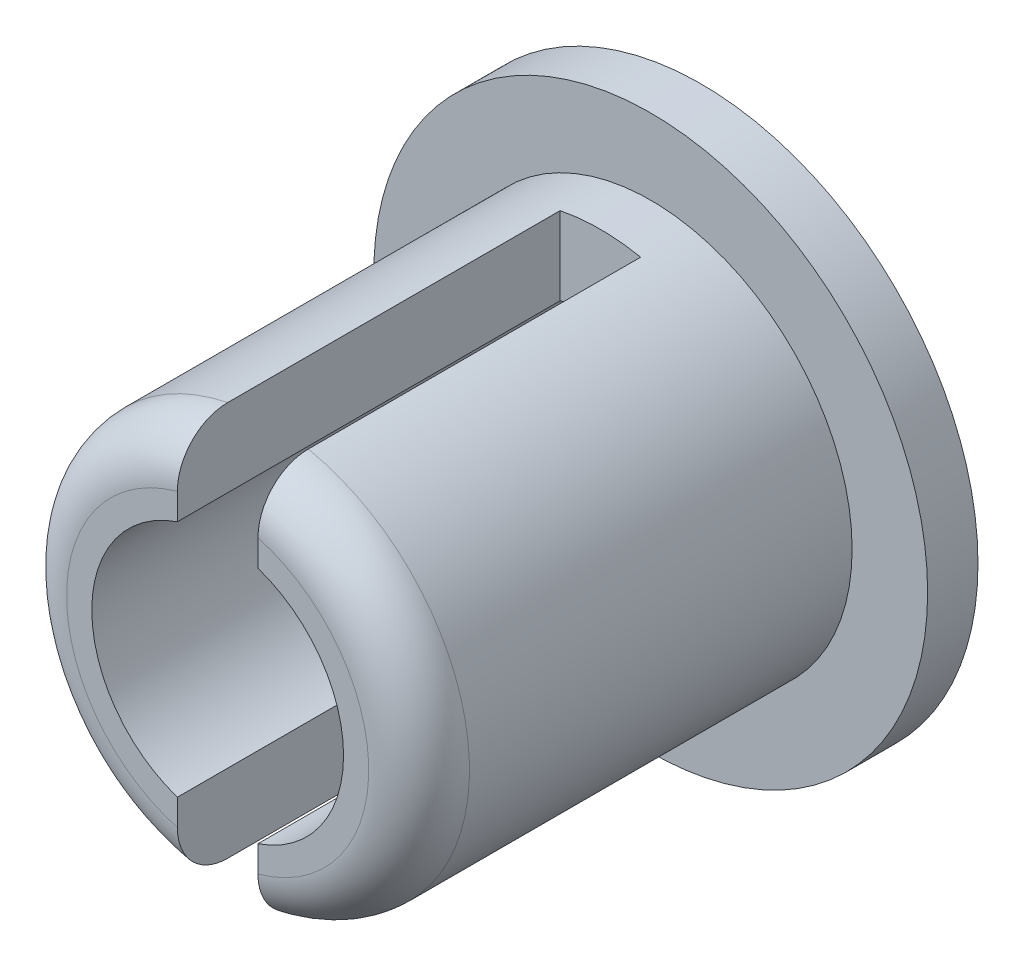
from build123d import *
from build123d.topology import SkipClean

# Parameters (mm, degrees)
ESQUISSE1_R        = 2.75
ESQUISSE1_R_2      = 1.25
BOSS_EXTRU_1_DEPTH = 0.5
ESQUISSE2_R        = 2
ESQUISSE2_R_2      = 1.25
BOSS_EXTRU_2_DEPTH = 0.5
BOSS_EXTRU_3_DEPTH = 3.8
CONG_1_R           = 0.5


with BuildPart() as part:
    # Esquisse1 → Boss.-Extru.1 (new body)
    with BuildSketch(Plane.XY):
        Circle(ESQUISSE1_R)
        Circle(ESQUISSE1_R_2, mode=Mode.SUBTRACT)
    extrude(amount=BOSS_EXTRU_1_DEPTH)

    # Esquisse2 → Boss.-Extru.2 (add)
    with BuildSketch(Plane.XY.offset(0.5)):
        Circle(ESQUISSE2_R)
        Circle(ESQUISSE2_R_2, mode=Mode.SUBTRACT)
    extrude(amount=BOSS_EXTRU_2_DEPTH)

    # Esquisse3 → Boss.-Extru.3 (add)
    with SkipClean():  # the faces are left unmerged after this step: merging them gives an invalid solid
        with BuildSketch(Plane.XY.offset(1)):
            with BuildLine():
                ThreePointArc((-0.3999999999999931, 1.959591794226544), (-2, -6.4e-16), (-0.3999999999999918, -1.9595917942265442))
                Line((-0.40000000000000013, -1.959591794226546), (-0.40000000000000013, -1.1842719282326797))
                ThreePointArc((-0.4000000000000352, -1.1842719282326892), (-1.25, 3.679e-14), (-0.3999999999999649, 1.184271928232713))
                Line((-0.40000000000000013, 1.1842719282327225), (-0.40000000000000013, 1.959591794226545))
            make_face()
            with BuildLine():
                Line((0.3999999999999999, -1.1842719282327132), (0.3999999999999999, -1.95959179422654))
                ThreePointArc((0.4000000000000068, -1.959591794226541), (1.5491933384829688, -1.2649110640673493), (2, -4.9e-16))
                ThreePointArc((2, 0), (1.549193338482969, 1.264911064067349), (0.4000000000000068, 1.959591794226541))
                Line((0.3999999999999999, 1.9595917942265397), (0.3999999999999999, 1.1842719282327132))
                ThreePointArc((0.3999999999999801, 1.1842719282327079), (1.0155048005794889, 0.728868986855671), (1.25, 0))
                ThreePointArc((1.25, -3.1e-16), (1.015504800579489, -0.7288689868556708), (0.39999999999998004, -1.1842719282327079))
            make_face()
        extrude(amount=BOSS_EXTRU_3_DEPTH)

    # Cong_1
    cong_1_edges = [part.edges().sort_by_distance(p)[0] for p in [
        (-2, -6.1e-16, 4.8),
        (2, 1e-15, 4.8),
    ]]
    fillet(cong_1_edges, radius=CONG_1_R)


solid = part.part
